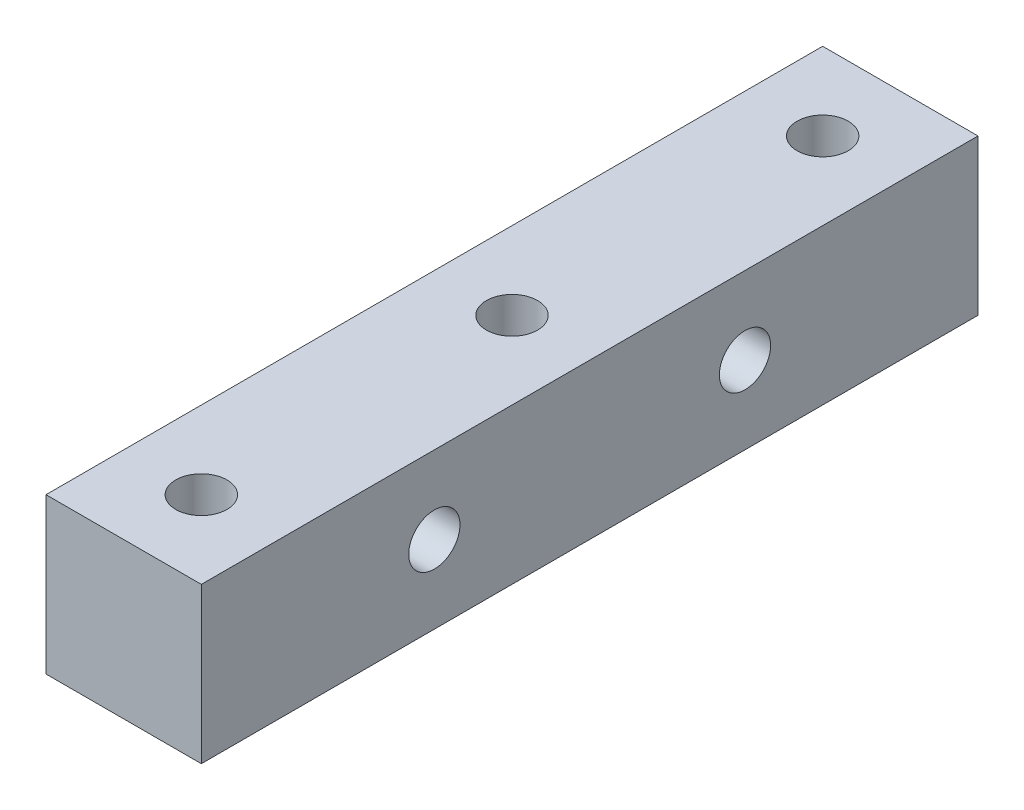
ISO-10303-21;
HEADER;
FILE_DESCRIPTION(('STEP AP214'),'2;1');
FILE_NAME('part.step','',(''),(''),'','','');
FILE_SCHEMA(('AUTOMOTIVE_DESIGN { 1 0 10303 214 1 1 1 1 }'));
ENDSEC;
DATA;
#1=APPLICATION_CONTEXT('core data for automotive mechanical design processes');
#2=APPLICATION_PROTOCOL_DEFINITION('international standard','automotive_design',2000,#1);
#3=PRODUCT_CONTEXT('',#1,'mechanical');
#4=PRODUCT('Part','Part','',(#3));
#5=PRODUCT_RELATED_PRODUCT_CATEGORY('part','',(#4));
#6=PRODUCT_DEFINITION_FORMATION('','',#4);
#7=PRODUCT_DEFINITION_CONTEXT('part definition',#1,'design');
#8=PRODUCT_DEFINITION('design','',#6,#7);
#9=PRODUCT_DEFINITION_SHAPE('','',#8);
#10=(LENGTH_UNIT() NAMED_UNIT(*) SI_UNIT(.MILLI.,.METRE.));
#11=(NAMED_UNIT(*) PLANE_ANGLE_UNIT() SI_UNIT($,.RADIAN.));
#12=(NAMED_UNIT(*) SI_UNIT($,.STERADIAN.) SOLID_ANGLE_UNIT());
#13=UNCERTAINTY_MEASURE_WITH_UNIT(LENGTH_MEASURE(1.E-05),#10,'distance_accuracy_value','');
#14=(GEOMETRIC_REPRESENTATION_CONTEXT(3) GLOBAL_UNCERTAINTY_ASSIGNED_CONTEXT((#13)) GLOBAL_UNIT_ASSIGNED_CONTEXT((#10,
#11,#12)) REPRESENTATION_CONTEXT('',''));
#15=CARTESIAN_POINT('',(0.,0.,0.));
#16=DIRECTION('',(0.,0.,1.));
#17=DIRECTION('',(1.,0.,0.));
#18=AXIS2_PLACEMENT_3D('',#15,#16,#17);
#19=CARTESIAN_POINT('',(5.,5.,50.));
#20=DIRECTION('',(-1.,0.,0.));
#21=DIRECTION('',(0.,0.,1.));
#22=AXIS2_PLACEMENT_3D('',#19,#20,#21);
#23=PLANE('',#22);
#24=CARTESIAN_POINT('',(5.,0.,35.));
#25=DIRECTION('',(1.,0.,0.));
#26=DIRECTION('',(0.,0.,-1.));
#27=AXIS2_PLACEMENT_3D('',#24,#25,#26);
#28=CIRCLE('',#27,1.64999999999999);
#29=CARTESIAN_POINT('',(5.,0.,33.35));
#30=VERTEX_POINT('',#29);
#31=EDGE_CURVE('E144',#30,#30,#28,.T.);
#32=ORIENTED_EDGE('',*,*,#31,.F.);
#33=EDGE_LOOP('',(#32));
#34=FACE_BOUND('',#33,.T.);
#35=CARTESIAN_POINT('',(5.,0.,15.));
#36=DIRECTION('',(1.,0.,0.));
#37=DIRECTION('',(0.,0.,-1.));
#38=AXIS2_PLACEMENT_3D('',#35,#36,#37);
#39=CIRCLE('',#38,1.64999999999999);
#40=CARTESIAN_POINT('',(5.,0.,13.35));
#41=VERTEX_POINT('',#40);
#42=EDGE_CURVE('E138',#41,#41,#39,.T.);
#43=ORIENTED_EDGE('',*,*,#42,.F.);
#44=EDGE_LOOP('',(#43));
#45=FACE_BOUND('',#44,.T.);
#46=DIRECTION('',(0.,1.,0.));
#47=VECTOR('',#46,1.);
#48=CARTESIAN_POINT('',(5.,5.,0.));
#49=LINE('',#48,#47);
#50=CARTESIAN_POINT('',(5.,-5.,0.));
#51=VERTEX_POINT('',#50);
#52=CARTESIAN_POINT('',(5.,5.,0.));
#53=VERTEX_POINT('',#52);
#54=EDGE_CURVE('E104',#51,#53,#49,.T.);
#55=ORIENTED_EDGE('',*,*,#54,.T.);
#56=DIRECTION('',(0.,0.,-1.));
#57=VECTOR('',#56,1.);
#58=CARTESIAN_POINT('',(5.,5.,50.));
#59=LINE('',#58,#57);
#60=CARTESIAN_POINT('',(5.,5.,50.));
#61=VERTEX_POINT('',#60);
#62=EDGE_CURVE('E11',#61,#53,#59,.T.);
#63=ORIENTED_EDGE('',*,*,#62,.F.);
#64=DIRECTION('',(0.,1.,0.));
#65=VECTOR('',#64,1.);
#66=CARTESIAN_POINT('',(5.,5.,50.));
#67=LINE('',#66,#65);
#68=CARTESIAN_POINT('',(5.,-5.,50.));
#69=VERTEX_POINT('',#68);
#70=EDGE_CURVE('E92',#69,#61,#67,.T.);
#71=ORIENTED_EDGE('',*,*,#70,.F.);
#72=DIRECTION('',(0.,0.,-1.));
#73=VECTOR('',#72,1.);
#74=CARTESIAN_POINT('',(5.,-5.,50.));
#75=LINE('',#74,#73);
#76=EDGE_CURVE('E100',#69,#51,#75,.T.);
#77=ORIENTED_EDGE('',*,*,#76,.T.);
#78=EDGE_LOOP('',(#55,#63,#71,#77));
#79=FACE_BOUND('',#78,.T.);
#80=ADVANCED_FACE('F41',(#34,#45,#79),#23,.F.);
#81=CARTESIAN_POINT('',(-5.,5.,50.));
#82=DIRECTION('',(0.,-1.,0.));
#83=DIRECTION('',(0.,0.,-1.));
#84=AXIS2_PLACEMENT_3D('',#81,#82,#83);
#85=PLANE('',#84);
#86=CARTESIAN_POINT('',(0.,5.,5.));
#87=DIRECTION('',(0.,1.,0.));
#88=DIRECTION('',(0.,0.,1.));
#89=AXIS2_PLACEMENT_3D('',#86,#87,#88);
#90=CIRCLE('',#89,1.64999999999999);
#91=CARTESIAN_POINT('',(0.,5.,6.64999999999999));
#92=VERTEX_POINT('',#91);
#93=EDGE_CURVE('E132',#92,#92,#90,.T.);
#94=ORIENTED_EDGE('',*,*,#93,.F.);
#95=EDGE_LOOP('',(#94));
#96=FACE_BOUND('',#95,.T.);
#97=CARTESIAN_POINT('',(0.,5.,25.));
#98=DIRECTION('',(0.,1.,0.));
#99=DIRECTION('',(0.,0.,1.));
#100=AXIS2_PLACEMENT_3D('',#97,#98,#99);
#101=CIRCLE('',#100,1.64999999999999);
#102=CARTESIAN_POINT('',(0.,5.,26.65));
#103=VERTEX_POINT('',#102);
#104=EDGE_CURVE('E126',#103,#103,#101,.T.);
#105=ORIENTED_EDGE('',*,*,#104,.F.);
#106=EDGE_LOOP('',(#105));
#107=FACE_BOUND('',#106,.T.);
#108=CARTESIAN_POINT('',(0.,5.,45.));
#109=DIRECTION('',(0.,1.,0.));
#110=DIRECTION('',(0.,0.,1.));
#111=AXIS2_PLACEMENT_3D('',#108,#109,#110);
#112=CIRCLE('',#111,1.64999999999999);
#113=CARTESIAN_POINT('',(0.,5.,46.65));
#114=VERTEX_POINT('',#113);
#115=EDGE_CURVE('E120',#114,#114,#112,.T.);
#116=ORIENTED_EDGE('',*,*,#115,.F.);
#117=EDGE_LOOP('',(#116));
#118=FACE_BOUND('',#117,.T.);
#119=DIRECTION('',(-1.,0.,0.));
#120=VECTOR('',#119,1.);
#121=CARTESIAN_POINT('',(-5.,5.,0.));
#122=LINE('',#121,#120);
#123=CARTESIAN_POINT('',(-5.,5.,0.));
#124=VERTEX_POINT('',#123);
#125=EDGE_CURVE('E96',#53,#124,#122,.T.);
#126=ORIENTED_EDGE('',*,*,#125,.T.);
#127=DIRECTION('',(0.,0.,-1.));
#128=VECTOR('',#127,1.);
#129=CARTESIAN_POINT('',(-5.,5.,50.));
#130=LINE('',#129,#128);
#131=CARTESIAN_POINT('',(-5.,5.,50.));
#132=VERTEX_POINT('',#131);
#133=EDGE_CURVE('E49',#132,#124,#130,.T.);
#134=ORIENTED_EDGE('',*,*,#133,.F.);
#135=DIRECTION('',(-1.,0.,0.));
#136=VECTOR('',#135,1.);
#137=CARTESIAN_POINT('',(-5.,5.,50.));
#138=LINE('',#137,#136);
#139=EDGE_CURVE('E87',#61,#132,#138,.T.);
#140=ORIENTED_EDGE('',*,*,#139,.F.);
#141=ORIENTED_EDGE('',*,*,#62,.T.);
#142=EDGE_LOOP('',(#126,#134,#140,#141));
#143=FACE_BOUND('',#142,.T.);
#144=ADVANCED_FACE('F95',(#96,#107,#118,#143),#85,.F.);
#145=CARTESIAN_POINT('',(-5.,5.,50.));
#146=DIRECTION('',(1.,0.,0.));
#147=DIRECTION('',(0.,1.,0.));
#148=AXIS2_PLACEMENT_3D('',#145,#146,#147);
#149=PLANE('',#148);
#150=CARTESIAN_POINT('',(-4.99999999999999,0.,35.));
#151=DIRECTION('',(1.,0.,0.));
#152=DIRECTION('',(0.,0.,-1.));
#153=AXIS2_PLACEMENT_3D('',#150,#151,#152);
#154=CIRCLE('',#153,1.64999999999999);
#155=CARTESIAN_POINT('',(-4.99999999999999,0.,33.35));
#156=VERTEX_POINT('',#155);
#157=EDGE_CURVE('E141',#156,#156,#154,.T.);
#158=ORIENTED_EDGE('',*,*,#157,.T.);
#159=EDGE_LOOP('',(#158));
#160=FACE_BOUND('',#159,.T.);
#161=CARTESIAN_POINT('',(-4.99999999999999,0.,15.));
#162=DIRECTION('',(1.,0.,0.));
#163=DIRECTION('',(0.,0.,-1.));
#164=AXIS2_PLACEMENT_3D('',#161,#162,#163);
#165=CIRCLE('',#164,1.64999999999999);
#166=CARTESIAN_POINT('',(-4.99999999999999,0.,13.35));
#167=VERTEX_POINT('',#166);
#168=EDGE_CURVE('E135',#167,#167,#165,.T.);
#169=ORIENTED_EDGE('',*,*,#168,.T.);
#170=EDGE_LOOP('',(#169));
#171=FACE_BOUND('',#170,.T.);
#172=DIRECTION('',(0.,-1.,0.));
#173=VECTOR('',#172,1.);
#174=CARTESIAN_POINT('',(-5.,5.,0.));
#175=LINE('',#174,#173);
#176=CARTESIAN_POINT('',(-5.,-5.,0.));
#177=VERTEX_POINT('',#176);
#178=EDGE_CURVE('E74',#124,#177,#175,.T.);
#179=ORIENTED_EDGE('',*,*,#178,.T.);
#180=DIRECTION('',(0.,0.,-1.));
#181=VECTOR('',#180,1.);
#182=CARTESIAN_POINT('',(-5.,-5.,50.));
#183=LINE('',#182,#181);
#184=CARTESIAN_POINT('',(-5.,-5.,50.));
#185=VERTEX_POINT('',#184);
#186=EDGE_CURVE('E97',#185,#177,#183,.T.);
#187=ORIENTED_EDGE('',*,*,#186,.F.);
#188=DIRECTION('',(0.,-1.,0.));
#189=VECTOR('',#188,1.);
#190=CARTESIAN_POINT('',(-5.,5.,50.));
#191=LINE('',#190,#189);
#192=EDGE_CURVE('E90',#132,#185,#191,.T.);
#193=ORIENTED_EDGE('',*,*,#192,.F.);
#194=ORIENTED_EDGE('',*,*,#133,.T.);
#195=EDGE_LOOP('',(#179,#187,#193,#194));
#196=FACE_BOUND('',#195,.T.);
#197=ADVANCED_FACE('F98',(#160,#171,#196),#149,.F.);
#198=CARTESIAN_POINT('',(-5.,-5.,50.));
#199=DIRECTION('',(0.,1.,0.));
#200=DIRECTION('',(0.,0.,1.));
#201=AXIS2_PLACEMENT_3D('',#198,#199,#200);
#202=PLANE('',#201);
#203=CARTESIAN_POINT('',(0.,-5.,5.));
#204=DIRECTION('',(0.,1.,0.));
#205=DIRECTION('',(0.,0.,1.));
#206=AXIS2_PLACEMENT_3D('',#203,#204,#205);
#207=CIRCLE('',#206,1.64999999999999);
#208=CARTESIAN_POINT('',(0.,-5.,6.64999999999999));
#209=VERTEX_POINT('',#208);
#210=EDGE_CURVE('E129',#209,#209,#207,.T.);
#211=ORIENTED_EDGE('',*,*,#210,.T.);
#212=EDGE_LOOP('',(#211));
#213=FACE_BOUND('',#212,.T.);
#214=CARTESIAN_POINT('',(0.,-5.,25.));
#215=DIRECTION('',(0.,1.,0.));
#216=DIRECTION('',(0.,0.,1.));
#217=AXIS2_PLACEMENT_3D('',#214,#215,#216);
#218=CIRCLE('',#217,1.64999999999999);
#219=CARTESIAN_POINT('',(0.,-5.,26.65));
#220=VERTEX_POINT('',#219);
#221=EDGE_CURVE('E123',#220,#220,#218,.T.);
#222=ORIENTED_EDGE('',*,*,#221,.T.);
#223=EDGE_LOOP('',(#222));
#224=FACE_BOUND('',#223,.T.);
#225=CARTESIAN_POINT('',(0.,-5.,45.));
#226=DIRECTION('',(0.,1.,0.));
#227=DIRECTION('',(0.,0.,1.));
#228=AXIS2_PLACEMENT_3D('',#225,#226,#227);
#229=CIRCLE('',#228,1.64999999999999);
#230=CARTESIAN_POINT('',(0.,-5.,46.65));
#231=VERTEX_POINT('',#230);
#232=EDGE_CURVE('E107',#231,#231,#229,.T.);
#233=ORIENTED_EDGE('',*,*,#232,.T.);
#234=EDGE_LOOP('',(#233));
#235=FACE_BOUND('',#234,.T.);
#236=DIRECTION('',(1.,0.,0.));
#237=VECTOR('',#236,1.);
#238=CARTESIAN_POINT('',(-5.,-5.,0.));
#239=LINE('',#238,#237);
#240=EDGE_CURVE('E80',#177,#51,#239,.T.);
#241=ORIENTED_EDGE('',*,*,#240,.T.);
#242=ORIENTED_EDGE('',*,*,#76,.F.);
#243=DIRECTION('',(1.,0.,0.));
#244=VECTOR('',#243,1.);
#245=CARTESIAN_POINT('',(-5.,-5.,50.));
#246=LINE('',#245,#244);
#247=EDGE_CURVE('E57',#185,#69,#246,.T.);
#248=ORIENTED_EDGE('',*,*,#247,.F.);
#249=ORIENTED_EDGE('',*,*,#186,.T.);
#250=EDGE_LOOP('',(#241,#242,#248,#249));
#251=FACE_BOUND('',#250,.T.);
#252=ADVANCED_FACE('F112',(#213,#224,#235,#251),#202,.F.);
#253=CARTESIAN_POINT('',(0.,0.,50.));
#254=DIRECTION('',(0.,0.,1.));
#255=DIRECTION('',(1.,0.,0.));
#256=AXIS2_PLACEMENT_3D('',#253,#254,#255);
#257=PLANE('',#256);
#258=ORIENTED_EDGE('',*,*,#70,.T.);
#259=ORIENTED_EDGE('',*,*,#139,.T.);
#260=ORIENTED_EDGE('',*,*,#192,.T.);
#261=ORIENTED_EDGE('',*,*,#247,.T.);
#262=EDGE_LOOP('',(#258,#259,#260,#261));
#263=FACE_BOUND('',#262,.T.);
#264=ADVANCED_FACE('F88',(#263),#257,.T.);
#265=CARTESIAN_POINT('',(0.,0.,0.));
#266=DIRECTION('',(0.,0.,1.));
#267=DIRECTION('',(1.,0.,0.));
#268=AXIS2_PLACEMENT_3D('',#265,#266,#267);
#269=PLANE('',#268);
#270=ORIENTED_EDGE('',*,*,#54,.F.);
#271=ORIENTED_EDGE('',*,*,#240,.F.);
#272=ORIENTED_EDGE('',*,*,#178,.F.);
#273=ORIENTED_EDGE('',*,*,#125,.F.);
#274=EDGE_LOOP('',(#270,#271,#272,#273));
#275=FACE_BOUND('',#274,.T.);
#276=ADVANCED_FACE('F115',(#275),#269,.F.);
#277=CARTESIAN_POINT('',(0.,5.,45.));
#278=DIRECTION('',(0.,1.,0.));
#279=DIRECTION('',(0.,0.,1.));
#280=AXIS2_PLACEMENT_3D('',#277,#278,#279);
#281=CYLINDRICAL_SURFACE('',#280,1.64999999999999);
#282=ORIENTED_EDGE('',*,*,#232,.F.);
#283=EDGE_LOOP('',(#282));
#284=FACE_BOUND('',#283,.T.);
#285=ORIENTED_EDGE('',*,*,#115,.T.);
#286=EDGE_LOOP('',(#285));
#287=FACE_BOUND('',#286,.T.);
#288=ADVANCED_FACE('F172',(#284,#287),#281,.F.);
#289=CARTESIAN_POINT('',(0.,5.,25.));
#290=DIRECTION('',(0.,1.,0.));
#291=DIRECTION('',(0.,0.,1.));
#292=AXIS2_PLACEMENT_3D('',#289,#290,#291);
#293=CYLINDRICAL_SURFACE('',#292,1.64999999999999);
#294=ORIENTED_EDGE('',*,*,#221,.F.);
#295=EDGE_LOOP('',(#294));
#296=FACE_BOUND('',#295,.T.);
#297=ORIENTED_EDGE('',*,*,#104,.T.);
#298=EDGE_LOOP('',(#297));
#299=FACE_BOUND('',#298,.T.);
#300=ADVANCED_FACE('F165',(#296,#299),#293,.F.);
#301=CARTESIAN_POINT('',(0.,5.,5.));
#302=DIRECTION('',(0.,1.,0.));
#303=DIRECTION('',(0.,0.,1.));
#304=AXIS2_PLACEMENT_3D('',#301,#302,#303);
#305=CYLINDRICAL_SURFACE('',#304,1.64999999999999);
#306=ORIENTED_EDGE('',*,*,#210,.F.);
#307=EDGE_LOOP('',(#306));
#308=FACE_BOUND('',#307,.T.);
#309=ORIENTED_EDGE('',*,*,#93,.T.);
#310=EDGE_LOOP('',(#309));
#311=FACE_BOUND('',#310,.T.);
#312=ADVANCED_FACE('F156',(#308,#311),#305,.F.);
#313=CARTESIAN_POINT('',(5.,0.,15.));
#314=DIRECTION('',(1.,0.,0.));
#315=DIRECTION('',(0.,0.,-1.));
#316=AXIS2_PLACEMENT_3D('',#313,#314,#315);
#317=CYLINDRICAL_SURFACE('',#316,1.64999999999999);
#318=ORIENTED_EDGE('',*,*,#168,.F.);
#319=EDGE_LOOP('',(#318));
#320=FACE_BOUND('',#319,.T.);
#321=ORIENTED_EDGE('',*,*,#42,.T.);
#322=EDGE_LOOP('',(#321));
#323=FACE_BOUND('',#322,.T.);
#324=ADVANCED_FACE('F154',(#320,#323),#317,.F.);
#325=CARTESIAN_POINT('',(5.,0.,35.));
#326=DIRECTION('',(1.,0.,0.));
#327=DIRECTION('',(0.,0.,-1.));
#328=AXIS2_PLACEMENT_3D('',#325,#326,#327);
#329=CYLINDRICAL_SURFACE('',#328,1.64999999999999);
#330=ORIENTED_EDGE('',*,*,#157,.F.);
#331=EDGE_LOOP('',(#330));
#332=FACE_BOUND('',#331,.T.);
#333=ORIENTED_EDGE('',*,*,#31,.T.);
#334=EDGE_LOOP('',(#333));
#335=FACE_BOUND('',#334,.T.);
#336=ADVANCED_FACE('F148',(#332,#335),#329,.F.);
#337=CLOSED_SHELL('',(#80,#144,#197,#252,#264,#276,#288,#300,#312,#324,#336));
#338=MANIFOLD_SOLID_BREP('B2',#337);
#339=ADVANCED_BREP_SHAPE_REPRESENTATION('',(#18,#338),#14);
#340=SHAPE_DEFINITION_REPRESENTATION(#9,#339);
ENDSEC;
END-ISO-10303-21;
